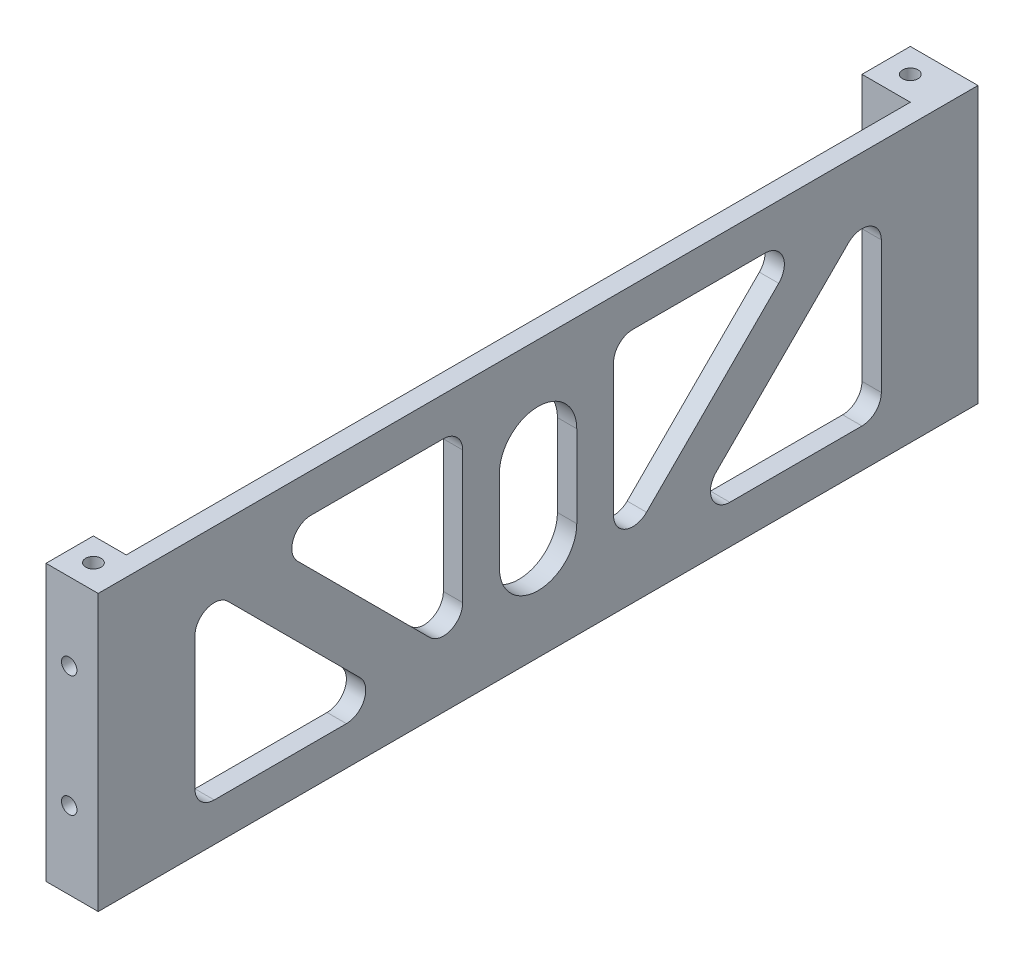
from build123d import *

# Parameters (mm, degrees)
SKETCH1_W                  = 91
SKETCH1_H                  = 28.5
BOSS_EXTRUDE1_DEPTH        = 2
SKETCH2_W                  = 5
SKETCH2_H                  = 28.5
BOSS_EXTRUDE2_DEPTH        = 5
BOSS_EXTRUDE3_DEPTH        = 3.4
M2_TAPPED_HOLE1_AT_2_COUNT = 2
M2_TAPPED_HOLE1_AT_2_PITCH = 86.013080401
M2_TAPPED_HOLE3_D          = 1.6
M2_TAPPED_HOLE3_DEPTH      = 5.2
M2_TAPPED_HOLE3_TIP        = 0.480688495
M2_TAPPED_HOLE4_D          = 1.6
M2_TAPPED_HOLE4_DEPTH      = 5.2
M2_TAPPED_HOLE4_TIP        = 0.480688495
CUT_EXTRUDE1_DEPTH         = 49.19037767
CUT_EXTRUDE2_DEPTH         = 10


with BuildPart() as part:
    # Sketch1 → Boss-Extrude1 (new body)
    with BuildSketch(Plane(origin=(0, 0, 0), x_dir=(0, 0, -1), z_dir=(1, 0, 0))):
        Rectangle(SKETCH1_W, SKETCH1_H)
    extrude(amount=BOSS_EXTRUDE1_DEPTH)

    # Sketch2 → Boss-Extrude2 (add)
    with BuildSketch(Plane.ZY):
        with Locations((-43, 0)):
            Rectangle(SKETCH2_W, SKETCH2_H)
    extrude(amount=BOSS_EXTRUDE2_DEPTH)

    # Sketch3 → Boss-Extrude3 (add)
    with BuildSketch(Plane.ZY):
        Polygon((45.5, -14.25), (40.6, -14.25), (40.6, 14.25), (45.5, 14.25), (45.5, -11.25), align=None)
    extrude(amount=BOSS_EXTRUDE3_DEPTH)

    # Sketch10 → M2 Tapped Hole1 (revolve, cut)
    with BuildSketch(Plane(origin=(-1, -14.25, 43), x_dir=(0, 0, -1), z_dir=(1, 0, 0))):
        Polygon((0, 0), (0, 5.680688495), (0.8, 5.2), (0.8, 0), align=None)
    m2_tapped_hole1 = revolve(axis=Axis((-1, -20.6, 43), (0, 1, 0)), mode=Mode.SUBTRACT)

    # M2 Tapped Hole1 at 2: M2 Tapped Hole1 ×2
    with Locations(*[Vector(-0.01743920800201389, 0, -0.9998479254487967) * (i * M2_TAPPED_HOLE1_AT_2_PITCH) for i in range(1, M2_TAPPED_HOLE1_AT_2_COUNT)]):
        add(m2_tapped_hole1, mode=Mode.SUBTRACT)

    # Mirror1: M2 Tapped Hole1 across plane
    add(m2_tapped_hole1.mirror(Plane.ZX), mode=Mode.SUBTRACT)

    # Mirror1 copy 1 sketch → Mirror1 copy 1 (revolve, cut)
    with BuildSketch(Plane(origin=(-2.5, 14.25, -43), x_dir=(0, 0, -1), z_dir=(1, 0, 0))):
        Polygon((0, 0), (0, -5.680688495), (0.8, -5.2), (0.8, 0), align=None)
    revolve(axis=Axis((-2.5, 20.6, -43), (0, 1, 0)), mode=Mode.SUBTRACT)

    # M2 Tapped Hole3
    with Locations(Plane(origin=(0, 0, -45.5), x_dir=(-1, 0, 0), z_dir=(0, 0, -1))):
        with Locations((1.5, 6.25), (1.5, -6.25)):
            Hole(M2_TAPPED_HOLE3_D / 2, depth=M2_TAPPED_HOLE3_DEPTH)
            with Locations((0, 0, -(M2_TAPPED_HOLE3_DEPTH + M2_TAPPED_HOLE3_TIP / 2))):  # 118° drill point
                Cone(0, M2_TAPPED_HOLE3_D / 2, M2_TAPPED_HOLE3_TIP, mode=Mode.SUBTRACT)

    # M2 Tapped Hole4
    with Locations(Plane(origin=(-1, 6.25, 45.5), x_dir=(1, 0, 0), z_dir=(0, 0, 1))):
        with Locations((0, 0), (0, -12.5)):
            Hole(M2_TAPPED_HOLE4_D / 2, depth=M2_TAPPED_HOLE4_DEPTH)
            with Locations((0, 0, -(M2_TAPPED_HOLE4_DEPTH + M2_TAPPED_HOLE4_TIP / 2))):  # 118° drill point
                Cone(0, M2_TAPPED_HOLE4_D / 2, M2_TAPPED_HOLE4_TIP, mode=Mode.SUBTRACT)

    # Sketch17 → Cut-Extrude1 (cut, through all)
    with BuildSketch(Plane(origin=(2, 0, 0), x_dir=(0, 0, -1), z_dir=(1, 0, 0))):
        with BuildLine():
            Line((-35.5, 5.421572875), (-35.5, -8.25))
            ThreePointArc((-35.5, -8.25), (-34.914213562, -9.664213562), (-33.5, -10.25))
            Line((-33.5, -10.25), (-19.828427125, -10.25))
            ThreePointArc((-19.828427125, -10.25), (-17.98066806, -9.015366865), (-18.414213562, -6.835786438))
            Line((-18.414213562, -6.835786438), (-32.085786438, 6.835786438))
            ThreePointArc((-32.085786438, 6.835786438), (-34.265366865, 7.26933194), (-35.5, 5.421572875))
        make_face()
        with BuildLine():
            Line((-24.885786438, 6.835786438), (-11.214213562, -6.835786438))
            ThreePointArc((-11.214213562, -6.835786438), (-9.034633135, -7.26933194), (-7.8, -5.421572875))
            Line((-7.8, -5.421572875), (-7.8, 8.25))
            ThreePointArc((-7.8, 8.25), (-8.385786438, 9.664213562), (-9.8, 10.25))
            Line((-9.8, 10.25), (-23.471572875, 10.25))
            ThreePointArc((-23.471572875, 10.25), (-25.31933194, 9.015366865), (-24.885786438, 6.835786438))
        make_face()
    cut_extrude1 = extrude(amount=-CUT_EXTRUDE1_DEPTH, mode=Mode.SUBTRACT)

    # Mirror2: Cut-Extrude1 across plane
    add(cut_extrude1.mirror(Plane.XY), mode=Mode.SUBTRACT)

    # Sketch18 → Cut-Extrude2 (cut)
    with BuildSketch(Plane(origin=(2, 0, 0), x_dir=(0, 0, -1), z_dir=(1, 0, 0))):
        with BuildLine():
            Line((4, 4.25), (4, -4.25))
            ThreePointArc((4, -4.25), (0, -8.25), (-4, -4.25))
            Line((-4, -4.25), (-4, 4.25))
            ThreePointArc((-4, 4.25), (0, 8.25), (4, 4.25))
        make_face()
    extrude(amount=-CUT_EXTRUDE2_DEPTH, mode=Mode.SUBTRACT)


solid = part.part
